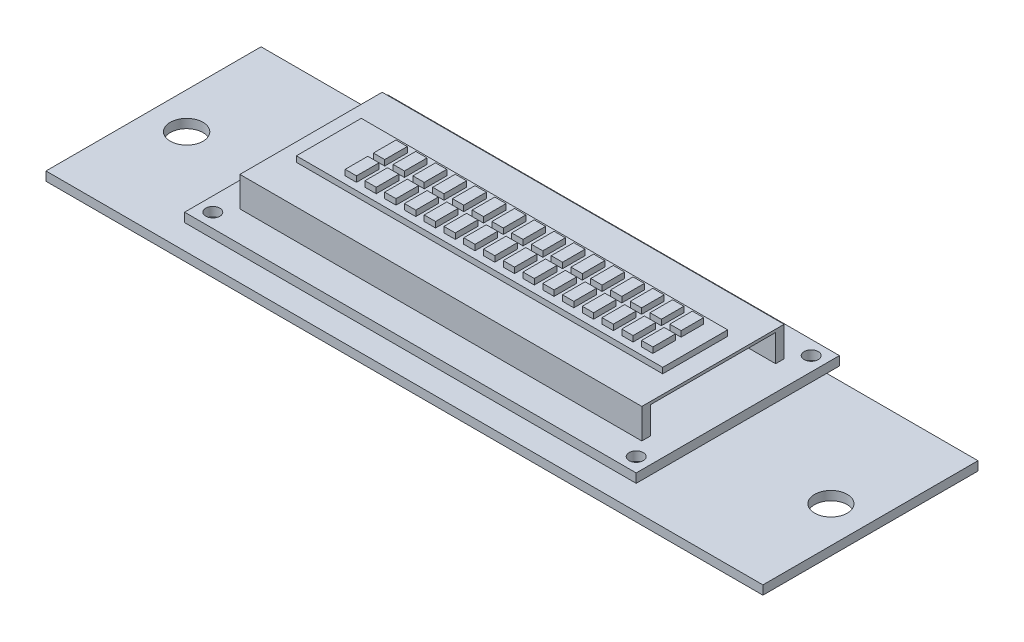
from build123d import *

# Parameters (mm, degrees)
SKETCH1_W           = 80
SKETCH1_H           = 36
BOSS_EXTRUDE1_DEPTH = 1.6
SKETCH2_R           = 1.25
CUT_EXTRUDE1_DEPTH  = 1.6
SKETCH4_W           = 71.2
SKETCH4_H           = 25.2
BOSS_EXTRUDE2_DEPTH = 0.5
SKETCH6_W           = 71.2
SKETCH6_H           = 1.5
BOSS_EXTRUDE3_DEPTH = 9.7
SKETCH7_W           = 64.9
SKETCH7_H           = 11.5
BOSS_EXTRUDE4_DEPTH = 1
SKETCH8_W           = 2
SKETCH8_H           = 4
BOSS_EXTRUDE5_DEPTH = 1
SKETCH9_W           = 127
SKETCH9_H           = 38.1
BOSS_EXTRUDE6_DEPTH = 1.5875
SKETCH11_R          = 2.888150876
SKETCH11_R_2        = 2.905588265
CUT_EXTRUDE2_DEPTH  = 1.5875


with BuildPart() as part:
    # Sketch1 → Boss-Extrude1 (new body)
    with BuildSketch(Plane(origin=(0, 0, 0), x_dir=(1, 0, 0), z_dir=(0, 1, 0))):
        Rectangle(SKETCH1_W, SKETCH1_H)
    extrude(amount=BOSS_EXTRUDE1_DEPTH)

    # Sketch2 → Cut-Extrude1 (cut)
    with BuildSketch(Plane(origin=(0, 1.6, 0), x_dir=(1, 0, 0), z_dir=(0, 1, 0))):
        with Locations(Location((-37.5, 15.5, 0), (0, 0, 270))):
            Circle(SKETCH2_R)
        with Locations(Location((37.5, 15.5, 0), (0, 0, 90))):
            Circle(SKETCH2_R)
        with Locations(Location((37.5, -15.5, 0), (0, 0, 270))):
            Circle(SKETCH2_R)
        with Locations(Location((-37.5, -15.5, 0), (0, 0, 90))):
            Circle(SKETCH2_R)
    extrude(amount=-CUT_EXTRUDE1_DEPTH, mode=Mode.SUBTRACT)


with BuildPart() as body_2:
    # Sketch4 → Boss-Extrude2 (new body)
    with BuildSketch(Plane(origin=(0, 6.4, 0), x_dir=(1, 0, 0), z_dir=(0, 1, 0))):
        Rectangle(SKETCH4_W, SKETCH4_H)
    extrude(amount=BOSS_EXTRUDE2_DEPTH)

    # Sketch6 → Boss-Extrude3 (add)
    with BuildSketch(Plane.XZ.offset(-6.4)):
        with Locations((0, -11.85)):
            Rectangle(SKETCH6_W, SKETCH6_H)
        with Locations((0, 11.85)):
            Rectangle(SKETCH6_W, SKETCH6_H)
    extrude(amount=BOSS_EXTRUDE3_DEPTH)

    # Sketch7 → Boss-Extrude4 (add)
    with BuildSketch(Plane(origin=(0, 6.9, 0), x_dir=(1, 0, 0), z_dir=(0, 1, 0))):
        Rectangle(SKETCH7_W, SKETCH7_H)
    extrude(amount=BOSS_EXTRUDE4_DEPTH)

    # Sketch8 → Boss-Extrude5 (add)
    with BuildSketch(Plane(origin=(0, 7.9, 0), x_dir=(1, 0, 0), z_dir=(0, 1, 0))):
        with Locations((24.95, -2.5)):
            Rectangle(SKETCH8_W, SKETCH8_H)
        with Locations((21.45, -2.5)):
            Rectangle(SKETCH8_W, SKETCH8_H)
        with Locations((21.45, 2.5)):
            Rectangle(SKETCH8_W, SKETCH8_H)
        with Locations((24.95, 2.5)):
            Rectangle(SKETCH8_W, SKETCH8_H)
        with Locations((28.45, 2.5)):
            Rectangle(SKETCH8_W, SKETCH8_H)
        with Locations((17.95, 2.5)):
            Rectangle(SKETCH8_W, SKETCH8_H)
        with Locations((17.95, -2.5)):
            Rectangle(SKETCH8_W, SKETCH8_H)
        with Locations((14.45, -2.5)):
            Rectangle(SKETCH8_W, SKETCH8_H)
        with Locations((14.45, 2.5)):
            Rectangle(SKETCH8_W, SKETCH8_H)
        with Locations((10.95, 2.5)):
            Rectangle(SKETCH8_W, SKETCH8_H)
        with Locations((10.95, -2.5)):
            Rectangle(SKETCH8_W, SKETCH8_H)
        with Locations((7.45, -2.5)):
            Rectangle(SKETCH8_W, SKETCH8_H)
        with Locations((7.45, 2.5)):
            Rectangle(SKETCH8_W, SKETCH8_H)
        with Locations((3.95, 2.5)):
            Rectangle(SKETCH8_W, SKETCH8_H)
        with Locations((3.95, -2.5)):
            Rectangle(SKETCH8_W, SKETCH8_H)
        with Locations((0.45, -2.5)):
            Rectangle(SKETCH8_W, SKETCH8_H)
        with Locations((0.45, 2.5)):
            Rectangle(SKETCH8_W, SKETCH8_H)
        with Locations((-3.05, 2.5)):
            Rectangle(SKETCH8_W, SKETCH8_H)
        with Locations((-3.05, -2.5)):
            Rectangle(SKETCH8_W, SKETCH8_H)
        with Locations((-6.55, -2.5)):
            Rectangle(SKETCH8_W, SKETCH8_H)
        with Locations((-10.05, 2.5)):
            Rectangle(SKETCH8_W, SKETCH8_H)
        with Locations((-6.55, 2.5)):
            Rectangle(SKETCH8_W, SKETCH8_H)
        with Locations((-10.05, -2.5)):
            Rectangle(SKETCH8_W, SKETCH8_H)
        with Locations((-13.55, -2.5)):
            Rectangle(SKETCH8_W, SKETCH8_H)
        with Locations((-13.55, 2.5)):
            Rectangle(SKETCH8_W, SKETCH8_H)
        with Locations((-17.05, 2.5)):
            Rectangle(SKETCH8_W, SKETCH8_H)
        with Locations((-17.05, -2.5)):
            Rectangle(SKETCH8_W, SKETCH8_H)
        with Locations((-20.55, -2.5)):
            Rectangle(SKETCH8_W, SKETCH8_H)
        with Locations((-20.55, 2.5)):
            Rectangle(SKETCH8_W, SKETCH8_H)
        with Locations((-24.05, 2.5)):
            Rectangle(SKETCH8_W, SKETCH8_H)
        with Locations((-24.05, -2.5)):
            Rectangle(SKETCH8_W, SKETCH8_H)
        with Locations((28.45, -2.5)):
            Rectangle(SKETCH8_W, SKETCH8_H)
    extrude(amount=BOSS_EXTRUDE5_DEPTH)

    # Sketch9 → Boss-Extrude6 (add)
    with BuildSketch(Plane.XZ.offset(3.3)):
        Rectangle(SKETCH9_W, SKETCH9_H)
    extrude(amount=BOSS_EXTRUDE6_DEPTH)

    # Sketch11 → Cut-Extrude2 (cut)
    with BuildSketch(Plane(origin=(0, -3.3, 0), x_dir=(1, 0, 0), z_dir=(0, 1, 0))):
        with Locations(Location((57.074668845, -0.578196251, 0), (0, 0, 270))):
            Circle(SKETCH11_R)
        with Locations(Location((-57.061551, -0.578196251, 0), (0, 0, 270))):
            Circle(SKETCH11_R_2)
    extrude(amount=-CUT_EXTRUDE2_DEPTH, mode=Mode.SUBTRACT)


solid = Compound([part.part, body_2.part])
